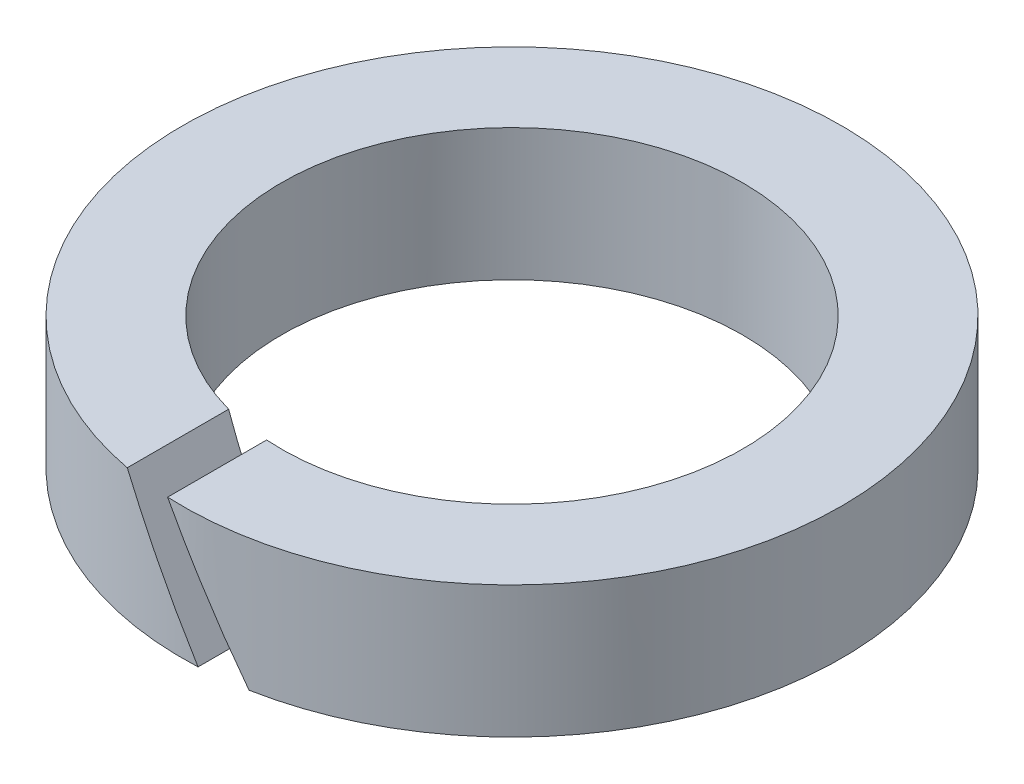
from build123d import *

# Parameters (mm, degrees)
SECTION_2_W = 1.5
SECTION_2_H = 2
FENTE_REACH = 9.25


with BuildPart() as part:
    # section 2 → R_volution (revolve)
    with BuildSketch(Plane.XY):
        with Locations((4.25, 0)):
            Rectangle(SECTION_2_W, SECTION_2_H)
    revolve(axis=Axis((0, 80, 0), (0, -1, 0)))

    # Sketch2 → fente (cut, up to next)
    with BuildSketch(Plane(origin=(0, 0.6, 0), x_dir=(-1, 0, 0), z_dir=(0, 0, -1)), mode=Mode.PRIVATE) as fente_sk1:
        Polygon((-0.923760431, -1.6), (0.230940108, 0.4), (0.923760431, 0.4), (-0.230940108, -1.6), align=None)
    fente_tool1 = extrude(fente_sk1.sketch, amount=-FENTE_REACH, mode=Mode.PRIVATE) & part.part
    add(fente_tool1.solids().sort_by_distance((0, 0, 0))[0], mode=Mode.SUBTRACT)


solid = part.part
